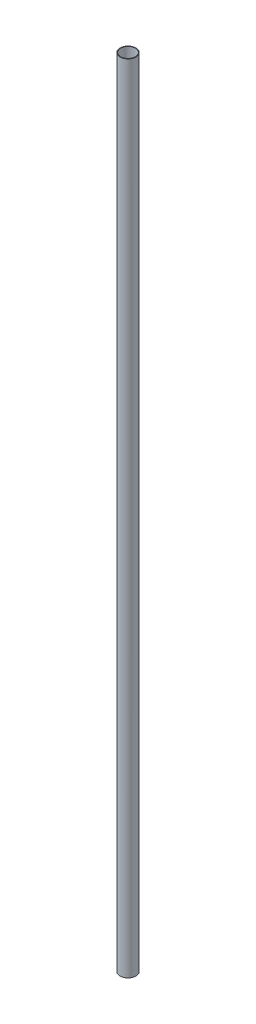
ISO-10303-21;
HEADER;
FILE_DESCRIPTION(('STEP AP214'),'2;1');
FILE_NAME('part.step','',(''),(''),'','','');
FILE_SCHEMA(('AUTOMOTIVE_DESIGN { 1 0 10303 214 1 1 1 1 }'));
ENDSEC;
DATA;
#1=APPLICATION_CONTEXT('core data for automotive mechanical design processes');
#2=APPLICATION_PROTOCOL_DEFINITION('international standard','automotive_design',2000,#1);
#3=PRODUCT_CONTEXT('',#1,'mechanical');
#4=PRODUCT('Part','Part','',(#3));
#5=PRODUCT_RELATED_PRODUCT_CATEGORY('part','',(#4));
#6=PRODUCT_DEFINITION_FORMATION('','',#4);
#7=PRODUCT_DEFINITION_CONTEXT('part definition',#1,'design');
#8=PRODUCT_DEFINITION('design','',#6,#7);
#9=PRODUCT_DEFINITION_SHAPE('','',#8);
#10=(LENGTH_UNIT() NAMED_UNIT(*) SI_UNIT(.MILLI.,.METRE.));
#11=(NAMED_UNIT(*) PLANE_ANGLE_UNIT() SI_UNIT($,.RADIAN.));
#12=(NAMED_UNIT(*) SI_UNIT($,.STERADIAN.) SOLID_ANGLE_UNIT());
#13=UNCERTAINTY_MEASURE_WITH_UNIT(LENGTH_MEASURE(1.E-05),#10,'distance_accuracy_value','');
#14=(GEOMETRIC_REPRESENTATION_CONTEXT(3) GLOBAL_UNCERTAINTY_ASSIGNED_CONTEXT((#13)) GLOBAL_UNIT_ASSIGNED_CONTEXT((#10,
#11,#12)) REPRESENTATION_CONTEXT('',''));
#15=CARTESIAN_POINT('',(0.,0.,0.));
#16=DIRECTION('',(0.,0.,1.));
#17=DIRECTION('',(1.,0.,0.));
#18=AXIS2_PLACEMENT_3D('',#15,#16,#17);
#19=CARTESIAN_POINT('',(0.,3000.,0.));
#20=DIRECTION('',(0.,1.,0.));
#21=DIRECTION('',(0.,0.,1.));
#22=AXIS2_PLACEMENT_3D('',#19,#20,#21);
#23=PLANE('',#22);
#24=CARTESIAN_POINT('',(0.,3000.,0.));
#25=DIRECTION('',(0.,1.,0.));
#26=DIRECTION('',(0.,0.,1.));
#27=AXIS2_PLACEMENT_3D('',#24,#25,#26);
#28=CIRCLE('',#27,30.);
#29=CARTESIAN_POINT('',(0.,3000.,30.));
#30=VERTEX_POINT('',#29);
#31=EDGE_CURVE('E143',#30,#30,#28,.T.);
#32=ORIENTED_EDGE('',*,*,#31,.T.);
#33=EDGE_LOOP('',(#32));
#34=FACE_BOUND('',#33,.T.);
#35=CARTESIAN_POINT('',(0.,3000.,0.));
#36=DIRECTION('',(0.,1.,0.));
#37=DIRECTION('',(0.,0.,1.));
#38=AXIS2_PLACEMENT_3D('',#35,#36,#37);
#39=CIRCLE('',#38,28.);
#40=CARTESIAN_POINT('',(0.,3000.,28.));
#41=VERTEX_POINT('',#40);
#42=EDGE_CURVE('E146',#41,#41,#39,.T.);
#43=ORIENTED_EDGE('',*,*,#42,.F.);
#44=EDGE_LOOP('',(#43));
#45=FACE_BOUND('',#44,.T.);
#46=ADVANCED_FACE('F33',(#34,#45),#23,.T.);
#47=CARTESIAN_POINT('',(0.,3000.,0.));
#48=DIRECTION('',(0.,-1.,0.));
#49=DIRECTION('',(0.,0.,-1.));
#50=AXIS2_PLACEMENT_3D('',#47,#48,#49);
#51=CYLINDRICAL_SURFACE('',#50,30.);
#52=CARTESIAN_POINT('',(-30.,102.5,0.));
#53=CARTESIAN_POINT('',(-30.0000009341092,102.499997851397,-0.139438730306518));
#54=CARTESIAN_POINT('',(-29.9990260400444,102.505834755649,-0.27884837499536));
#55=CARTESIAN_POINT('',(-29.9951557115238,102.529134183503,-0.556708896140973));
#56=CARTESIAN_POINT('',(-29.9922598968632,102.546599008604,-0.695159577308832));
#57=CARTESIAN_POINT('',(-29.9846251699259,102.593038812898,-0.970150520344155));
#58=CARTESIAN_POINT('',(-29.979885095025,102.622021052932,-1.10668952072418));
#59=CARTESIAN_POINT('',(-29.9686930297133,102.691286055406,-1.37685247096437));
#60=CARTESIAN_POINT('',(-29.9622404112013,102.731572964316,-1.51047533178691));
#61=CARTESIAN_POINT('',(-29.9478128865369,102.823085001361,-1.77365528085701));
#62=CARTESIAN_POINT('',(-29.9398398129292,102.874296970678,-1.90321704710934));
#63=CARTESIAN_POINT('',(-29.9225843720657,102.987331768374,-2.15759207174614));
#64=CARTESIAN_POINT('',(-29.9133015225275,103.049158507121,-2.28240355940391));
#65=CARTESIAN_POINT('',(-29.8936901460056,103.182931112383,-2.5263122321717));
#66=CARTESIAN_POINT('',(-29.8833621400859,103.254871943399,-2.64541222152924));
#67=CARTESIAN_POINT('',(-29.8619368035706,103.408417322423,-2.87720075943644));
#68=CARTESIAN_POINT('',(-29.8508391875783,103.490025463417,-2.98988690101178));
#69=CARTESIAN_POINT('',(-29.8280901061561,103.66302595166,-3.20893550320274));
#70=CARTESIAN_POINT('',(-29.8164348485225,103.754492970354,-3.3152386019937));
#71=CARTESIAN_POINT('',(-29.792977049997,103.946055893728,-3.51981905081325));
#72=CARTESIAN_POINT('',(-29.7811744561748,104.04615498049,-3.6180934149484));
#73=CARTESIAN_POINT('',(-29.757760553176,104.254234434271,-3.80586900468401));
#74=CARTESIAN_POINT('',(-29.7461491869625,104.362212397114,-3.89537288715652));
#75=CARTESIAN_POINT('',(-29.7234367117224,104.58537924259,-4.06505128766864));
#76=CARTESIAN_POINT('',(-29.7123357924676,104.700570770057,-4.14522235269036));
#77=CARTESIAN_POINT('',(-29.6909016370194,104.938028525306,-4.29606801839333));
#78=CARTESIAN_POINT('',(-29.6805732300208,105.060331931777,-4.36668480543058));
#79=CARTESIAN_POINT('',(-29.6610510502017,105.310589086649,-4.49737903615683));
#80=CARTESIAN_POINT('',(-29.6518577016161,105.438544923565,-4.55745254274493));
#81=CARTESIAN_POINT('',(-29.6348831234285,105.699119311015,-4.66655756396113));
#82=CARTESIAN_POINT('',(-29.6271012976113,105.831735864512,-4.7155937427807));
#83=CARTESIAN_POINT('',(-29.6131700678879,106.100732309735,-4.80229722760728));
#84=CARTESIAN_POINT('',(-29.6070212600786,106.237113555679,-4.83996038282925));
#85=CARTESIAN_POINT('',(-29.5914227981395,106.647801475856,-4.93477467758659));
#86=CARTESIAN_POINT('',(-29.5846386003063,106.92636886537,-4.97488357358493));
#87=CARTESIAN_POINT('',(-29.5790755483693,107.486203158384,-5.00784793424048));
#88=CARTESIAN_POINT('',(-29.5802961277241,107.767469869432,-5.00070674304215));
#89=CARTESIAN_POINT('',(-29.590529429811,108.321844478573,-4.93978637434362));
#90=CARTESIAN_POINT('',(-29.5994616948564,108.59500659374,-4.88648873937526));
#91=CARTESIAN_POINT('',(-29.6239896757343,109.128445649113,-4.73550730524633));
#92=CARTESIAN_POINT('',(-29.6395856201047,109.388722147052,-4.63782198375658));
#93=CARTESIAN_POINT('',(-29.6757696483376,109.890456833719,-4.40035421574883));
#94=CARTESIAN_POINT('',(-29.6963813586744,110.131818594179,-4.2603717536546));
#95=CARTESIAN_POINT('',(-29.7402583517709,110.587809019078,-3.94242410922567));
#96=CARTESIAN_POINT('',(-29.7635238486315,110.802435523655,-3.76445586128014));
#97=CARTESIAN_POINT('',(-29.8104405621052,111.201652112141,-3.37296440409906));
#98=CARTESIAN_POINT('',(-29.8340929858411,111.38583702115,-3.15902792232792));
#99=CARTESIAN_POINT('',(-29.8788520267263,111.715755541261,-2.70307050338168));
#100=CARTESIAN_POINT('',(-29.8999586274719,111.861488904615,-2.46104938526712));
#101=CARTESIAN_POINT('',(-29.9372778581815,112.11040445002,-1.95541183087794));
#102=CARTESIAN_POINT('',(-29.9534863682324,112.213550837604,-1.69177745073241));
#103=CARTESIAN_POINT('',(-29.9791500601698,112.37398843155,-1.15059669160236));
#104=CARTESIAN_POINT('',(-29.988605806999,112.431283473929,-0.873051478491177));
#105=CARTESIAN_POINT('',(-29.999622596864,112.497842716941,-0.315419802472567));
#106=CARTESIAN_POINT('',(-30.0012750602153,112.507663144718,-0.0354014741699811));
#107=CARTESIAN_POINT('',(-29.9967494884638,112.480477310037,0.522279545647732));
#108=CARTESIAN_POINT('',(-29.9905717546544,112.443472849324,0.799942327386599));
#109=CARTESIAN_POINT('',(-29.971136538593,112.324150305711,1.3433123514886));
#110=CARTESIAN_POINT('',(-29.9579220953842,112.242107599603,1.60908173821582));
#111=CARTESIAN_POINT('',(-29.9258892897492,112.035330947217,2.12309376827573));
#112=CARTESIAN_POINT('',(-29.9070706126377,111.910594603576,2.37133542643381));
#113=CARTESIAN_POINT('',(-29.8656903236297,111.620697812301,2.84566138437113));
#114=CARTESIAN_POINT('',(-29.8430971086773,111.455189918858,3.07153052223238));
#115=CARTESIAN_POINT('',(-29.7967693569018,111.088925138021,3.49248715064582));
#116=CARTESIAN_POINT('',(-29.7730347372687,110.88816569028,3.68757240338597));
#117=CARTESIAN_POINT('',(-29.7268034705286,110.454605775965,4.04348563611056));
#118=CARTESIAN_POINT('',(-29.7043221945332,110.221494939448,4.20393781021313));
#119=CARTESIAN_POINT('',(-29.6634307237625,109.73129079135,4.48340433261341));
#120=CARTESIAN_POINT('',(-29.6450203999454,109.474198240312,4.60241999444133));
#121=CARTESIAN_POINT('',(-29.6144685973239,108.944432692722,4.79507773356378));
#122=CARTESIAN_POINT('',(-29.602301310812,108.671829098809,4.86890685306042));
#123=CARTESIAN_POINT('',(-29.5855561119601,108.117714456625,4.96966691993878));
#124=CARTESIAN_POINT('',(-29.580977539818,107.836204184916,4.99660194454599));
#125=CARTESIAN_POINT('',(-29.5801885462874,107.415590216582,5.0012321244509));
#126=CARTESIAN_POINT('',(-29.5809172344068,107.276463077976,4.99693975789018));
#127=CARTESIAN_POINT('',(-29.5843160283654,106.999087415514,4.97678436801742));
#128=CARTESIAN_POINT('',(-29.5869854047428,106.860838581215,4.96092569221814));
#129=CARTESIAN_POINT('',(-29.5941926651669,106.586152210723,4.91774640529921));
#130=CARTESIAN_POINT('',(-29.5987312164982,106.449715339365,4.89042170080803));
#131=CARTESIAN_POINT('',(-29.6095423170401,106.179703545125,4.82453301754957));
#132=CARTESIAN_POINT('',(-29.615814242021,106.046127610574,4.7859730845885));
#133=CARTESIAN_POINT('',(-29.6299071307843,105.782831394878,4.6979342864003));
#134=CARTESIAN_POINT('',(-29.6377268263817,105.653108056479,4.6484643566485));
#135=CARTESIAN_POINT('',(-29.6546930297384,105.398341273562,4.53896986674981));
#136=CARTESIAN_POINT('',(-29.6638390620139,105.273296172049,4.47894908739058));
#137=CARTESIAN_POINT('',(-29.6832065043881,105.0286385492,4.34874498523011));
#138=CARTESIAN_POINT('',(-29.6934283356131,104.909028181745,4.27855767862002));
#139=CARTESIAN_POINT('',(-29.7146554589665,104.676138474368,4.12855715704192));
#140=CARTESIAN_POINT('',(-29.7256604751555,104.562856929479,4.04874732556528));
#141=CARTESIAN_POINT('',(-29.7482907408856,104.341991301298,3.87899685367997));
#142=CARTESIAN_POINT('',(-29.7599219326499,104.234493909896,3.78894418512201));
#143=CARTESIAN_POINT('',(-29.783347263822,104.027486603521,3.60017574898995));
#144=CARTESIAN_POINT('',(-29.7951413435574,103.927973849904,3.50146308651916));
#145=CARTESIAN_POINT('',(-29.8185735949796,103.737518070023,3.29596225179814));
#146=CARTESIAN_POINT('',(-29.8302116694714,103.646580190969,3.18916929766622));
#147=CARTESIAN_POINT('',(-29.8529952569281,103.474004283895,2.96833108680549));
#148=CARTESIAN_POINT('',(-29.8641409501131,103.392362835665,2.8542885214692));
#149=CARTESIAN_POINT('',(-29.8857116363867,103.238354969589,2.6188382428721));
#150=CARTESIAN_POINT('',(-29.896130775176,103.166060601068,2.49738284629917));
#151=CARTESIAN_POINT('',(-29.9158586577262,103.032003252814,2.24876507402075));
#152=CARTESIAN_POINT('',(-29.925167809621,102.970236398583,2.1216048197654));
#153=CARTESIAN_POINT('',(-29.9424090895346,102.857699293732,1.86251821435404));
#154=CARTESIAN_POINT('',(-29.950342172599,102.806921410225,1.73059524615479));
#155=CARTESIAN_POINT('',(-29.9646113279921,102.716705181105,1.46288984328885));
#156=CARTESIAN_POINT('',(-29.9709477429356,102.677264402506,1.32710824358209));
#157=CARTESIAN_POINT('',(-29.9841083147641,102.59602169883,0.995492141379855));
#158=CARTESIAN_POINT('',(-29.9900398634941,102.560056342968,0.798161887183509));
#159=CARTESIAN_POINT('',(-29.9979850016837,102.512047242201,0.400534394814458));
#160=CARTESIAN_POINT('',(-29.9999986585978,102.500003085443,0.20023720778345));
#161=CARTESIAN_POINT('',(-30.,102.5,0.));
#162=B_SPLINE_CURVE_WITH_KNOTS('',3,(#52,#53,#54,#55,#56,#57,#58,#59,#60,#61,#62,#63,#64,#65,
#66,#67,#68,#69,#70,#71,#72,#73,#74,#75,#76,#77,#78,#79,#80,#81,#82,#83,#84,#85,#86,#87,#88,#89,
#90,#91,#92,#93,#94,#95,#96,#97,#98,#99,#100,#101,#102,#103,#104,#105,#106,#107,#108,#109,#110,
#111,#112,#113,#114,#115,#116,#117,#118,#119,#120,#121,#122,#123,#124,#125,#126,#127,#128,#129,
#130,#131,#132,#133,#134,#135,#136,#137,#138,#139,#140,#141,#142,#143,#144,#145,#146,#147,#148,
#149,#150,#151,#152,#153,#154,#155,#156,#157,#158,#159,#160,#161),.UNSPECIFIED.,.T.,.F.,(4,2,2,
2,2,2,2,2,2,2,2,2,2,2,2,2,2,2,2,2,2,2,2,2,2,2,2,2,2,2,2,2,2,2,2,2,2,2,2,2,2,2,2,2,2,2,2,2,2,2,2,
2,2,2,4),(0.,0.418140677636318,0.83636414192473,1.25485168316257,1.67349292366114,
2.09163274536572,2.50992693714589,2.92801360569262,3.3462561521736,3.767924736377,
4.18974943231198,4.61144594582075,5.03329798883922,5.45759827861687,5.88205667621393,
6.30633536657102,6.73076871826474,7.57090272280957,8.41097726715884,9.24239161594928,
10.0738344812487,10.9092723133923,11.7447775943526,12.5906365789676,13.4365010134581,
14.2830749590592,15.1295780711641,15.9661388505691,16.8026674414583,17.6341373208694,
18.4656538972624,19.3045176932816,20.1434424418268,20.9910576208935,21.83864592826,
22.6827016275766,23.5266839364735,23.9438629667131,24.3608852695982,24.77805657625,
25.1950778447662,25.611758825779,26.0282907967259,26.4449864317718,26.8615359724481,
27.2831832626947,27.7046799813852,28.1264281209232,28.5480205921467,28.9726903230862,
29.3972034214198,29.8214207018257,30.2455468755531,30.8460167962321,31.4464763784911),.UNSPECIFIED.);
#163=CARTESIAN_POINT('',(-30.,102.5,0.));
#164=VERTEX_POINT('',#163);
#165=EDGE_CURVE('E161',#164,#164,#162,.T.);
#166=ORIENTED_EDGE('',*,*,#165,.T.);
#167=EDGE_LOOP('',(#166));
#168=FACE_BOUND('',#167,.T.);
#169=CARTESIAN_POINT('',(-30.,42.5,0.));
#170=CARTESIAN_POINT('',(-30.0000009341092,42.499997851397,-0.139438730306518));
#171=CARTESIAN_POINT('',(-29.9990260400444,42.5058347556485,-0.278848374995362));
#172=CARTESIAN_POINT('',(-29.9951557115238,42.5291341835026,-0.556708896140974));
#173=CARTESIAN_POINT('',(-29.9922598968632,42.5465990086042,-0.695159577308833));
#174=CARTESIAN_POINT('',(-29.9846251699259,42.5930388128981,-0.970150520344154));
#175=CARTESIAN_POINT('',(-29.979885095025,42.6220210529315,-1.10668952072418));
#176=CARTESIAN_POINT('',(-29.9686930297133,42.6912860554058,-1.37685247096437));
#177=CARTESIAN_POINT('',(-29.9622404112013,42.7315729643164,-1.51047533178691));
#178=CARTESIAN_POINT('',(-29.9478128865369,42.8230850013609,-1.77365528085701));
#179=CARTESIAN_POINT('',(-29.9398398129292,42.8742969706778,-1.90321704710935));
#180=CARTESIAN_POINT('',(-29.9225843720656,42.987331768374,-2.15759207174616));
#181=CARTESIAN_POINT('',(-29.9133015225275,43.0491585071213,-2.28240355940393));
#182=CARTESIAN_POINT('',(-29.8936901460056,43.1829311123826,-2.52631223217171));
#183=CARTESIAN_POINT('',(-29.8833621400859,43.2548719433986,-2.64541222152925));
#184=CARTESIAN_POINT('',(-29.8619368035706,43.4084173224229,-2.87720075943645));
#185=CARTESIAN_POINT('',(-29.8508391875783,43.4900254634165,-2.98988690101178));
#186=CARTESIAN_POINT('',(-29.8280901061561,43.6630259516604,-3.20893550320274));
#187=CARTESIAN_POINT('',(-29.8164348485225,43.7544929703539,-3.3152386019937));
#188=CARTESIAN_POINT('',(-29.792977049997,43.9460558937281,-3.51981905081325));
#189=CARTESIAN_POINT('',(-29.7811744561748,44.0461549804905,-3.6180934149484));
#190=CARTESIAN_POINT('',(-29.757760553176,44.2542344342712,-3.80586900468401));
#191=CARTESIAN_POINT('',(-29.7461491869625,44.362212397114,-3.89537288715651));
#192=CARTESIAN_POINT('',(-29.7234367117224,44.5853792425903,-4.06505128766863));
#193=CARTESIAN_POINT('',(-29.7123357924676,44.7005707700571,-4.14522235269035));
#194=CARTESIAN_POINT('',(-29.6909016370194,44.9380285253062,-4.29606801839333));
#195=CARTESIAN_POINT('',(-29.6805732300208,45.0603319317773,-4.36668480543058));
#196=CARTESIAN_POINT('',(-29.6610510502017,45.3105890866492,-4.49737903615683));
#197=CARTESIAN_POINT('',(-29.6518577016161,45.4385449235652,-4.55745254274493));
#198=CARTESIAN_POINT('',(-29.6348831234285,45.699119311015,-4.66655756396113));
#199=CARTESIAN_POINT('',(-29.6271012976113,45.8317358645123,-4.7155937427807));
#200=CARTESIAN_POINT('',(-29.6131700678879,46.100732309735,-4.80229722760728));
#201=CARTESIAN_POINT('',(-29.6070212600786,46.2371135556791,-4.83996038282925));
#202=CARTESIAN_POINT('',(-29.5914227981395,46.6478014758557,-4.93477467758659));
#203=CARTESIAN_POINT('',(-29.5846386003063,46.9263688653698,-4.97488357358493));
#204=CARTESIAN_POINT('',(-29.5790755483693,47.4862031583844,-5.00784793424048));
#205=CARTESIAN_POINT('',(-29.5802961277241,47.7674698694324,-5.00070674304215));
#206=CARTESIAN_POINT('',(-29.590529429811,48.3218444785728,-4.93978637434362));
#207=CARTESIAN_POINT('',(-29.5994616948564,48.5950065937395,-4.88648873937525));
#208=CARTESIAN_POINT('',(-29.6239896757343,49.1284456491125,-4.73550730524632));
#209=CARTESIAN_POINT('',(-29.6395856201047,49.3887221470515,-4.63782198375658));
#210=CARTESIAN_POINT('',(-29.6757696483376,49.8904568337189,-4.40035421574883));
#211=CARTESIAN_POINT('',(-29.6963813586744,50.1318185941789,-4.26037175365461));
#212=CARTESIAN_POINT('',(-29.7402583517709,50.5878090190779,-3.94242410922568));
#213=CARTESIAN_POINT('',(-29.7635238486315,50.8024355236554,-3.76445586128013));
#214=CARTESIAN_POINT('',(-29.8104405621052,51.2016521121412,-3.37296440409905));
#215=CARTESIAN_POINT('',(-29.8340929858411,51.3858370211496,-3.15902792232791));
#216=CARTESIAN_POINT('',(-29.8788520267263,51.7157555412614,-2.70307050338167));
#217=CARTESIAN_POINT('',(-29.8999586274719,51.861488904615,-2.46104938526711));
#218=CARTESIAN_POINT('',(-29.9372778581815,52.1104044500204,-1.95541183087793));
#219=CARTESIAN_POINT('',(-29.9534863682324,52.2135508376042,-1.6917774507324));
#220=CARTESIAN_POINT('',(-29.9791500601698,52.3739884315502,-1.15059669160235));
#221=CARTESIAN_POINT('',(-29.988605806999,52.4312834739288,-0.873051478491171));
#222=CARTESIAN_POINT('',(-29.999622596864,52.4978427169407,-0.315419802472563));
#223=CARTESIAN_POINT('',(-30.0012750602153,52.5076631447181,-0.0354014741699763));
#224=CARTESIAN_POINT('',(-29.9967494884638,52.4804773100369,0.522279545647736));
#225=CARTESIAN_POINT('',(-29.9905717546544,52.4434728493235,0.799942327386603));
#226=CARTESIAN_POINT('',(-29.971136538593,52.3241503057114,1.3433123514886));
#227=CARTESIAN_POINT('',(-29.9579220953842,52.2421075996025,1.60908173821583));
#228=CARTESIAN_POINT('',(-29.9258892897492,52.0353309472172,2.12309376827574));
#229=CARTESIAN_POINT('',(-29.9070706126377,51.9105946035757,2.37133542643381));
#230=CARTESIAN_POINT('',(-29.8656903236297,51.6206978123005,2.84566138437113));
#231=CARTESIAN_POINT('',(-29.8430971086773,51.4551899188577,3.07153052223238));
#232=CARTESIAN_POINT('',(-29.7967693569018,51.0889251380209,3.49248715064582));
#233=CARTESIAN_POINT('',(-29.7730347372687,50.8881656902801,3.68757240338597));
#234=CARTESIAN_POINT('',(-29.7268034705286,50.4546057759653,4.04348563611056));
#235=CARTESIAN_POINT('',(-29.7043221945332,50.2214949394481,4.20393781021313));
#236=CARTESIAN_POINT('',(-29.6634307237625,49.7312907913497,4.48340433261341));
#237=CARTESIAN_POINT('',(-29.6450203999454,49.4741982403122,4.60241999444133));
#238=CARTESIAN_POINT('',(-29.6144685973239,48.9444326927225,4.79507773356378));
#239=CARTESIAN_POINT('',(-29.602301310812,48.6718290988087,4.86890685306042));
#240=CARTESIAN_POINT('',(-29.5855561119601,48.1177144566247,4.96966691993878));
#241=CARTESIAN_POINT('',(-29.580977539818,47.8362041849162,4.99660194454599));
#242=CARTESIAN_POINT('',(-29.5801885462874,47.4155902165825,5.0012321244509));
#243=CARTESIAN_POINT('',(-29.5809172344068,47.2764630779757,4.99693975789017));
#244=CARTESIAN_POINT('',(-29.5843160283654,46.9990874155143,4.97678436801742));
#245=CARTESIAN_POINT('',(-29.5869854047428,46.8608385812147,4.96092569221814));
#246=CARTESIAN_POINT('',(-29.5941926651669,46.5861522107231,4.91774640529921));
#247=CARTESIAN_POINT('',(-29.5987312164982,46.4497153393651,4.89042170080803));
#248=CARTESIAN_POINT('',(-29.6095423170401,46.1797035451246,4.82453301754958));
#249=CARTESIAN_POINT('',(-29.615814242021,46.0461276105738,4.7859730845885));
#250=CARTESIAN_POINT('',(-29.6299071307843,45.7828313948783,4.6979342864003));
#251=CARTESIAN_POINT('',(-29.6377268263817,45.653108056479,4.6484643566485));
#252=CARTESIAN_POINT('',(-29.6546930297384,45.3983412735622,4.53896986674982));
#253=CARTESIAN_POINT('',(-29.6638390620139,45.273296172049,4.47894908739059));
#254=CARTESIAN_POINT('',(-29.6832065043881,45.0286385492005,4.34874498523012));
#255=CARTESIAN_POINT('',(-29.6934283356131,44.9090281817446,4.27855767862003));
#256=CARTESIAN_POINT('',(-29.7146554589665,44.6761384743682,4.12855715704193));
#257=CARTESIAN_POINT('',(-29.7256604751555,44.5628569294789,4.04874732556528));
#258=CARTESIAN_POINT('',(-29.7482907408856,44.3419913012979,3.87899685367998));
#259=CARTESIAN_POINT('',(-29.7599219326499,44.2344939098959,3.78894418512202));
#260=CARTESIAN_POINT('',(-29.783347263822,44.027486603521,3.60017574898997));
#261=CARTESIAN_POINT('',(-29.7951413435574,43.9279738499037,3.50146308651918));
#262=CARTESIAN_POINT('',(-29.8185735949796,43.7375180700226,3.29596225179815));
#263=CARTESIAN_POINT('',(-29.8302116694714,43.6465801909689,3.18916929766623));
#264=CARTESIAN_POINT('',(-29.8529952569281,43.4740042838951,2.9683310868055));
#265=CARTESIAN_POINT('',(-29.8641409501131,43.3923628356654,2.8542885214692));
#266=CARTESIAN_POINT('',(-29.8857116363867,43.2383549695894,2.61883824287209));
#267=CARTESIAN_POINT('',(-29.896130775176,43.1660606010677,2.49738284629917));
#268=CARTESIAN_POINT('',(-29.9158586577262,43.0320032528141,2.24876507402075));
#269=CARTESIAN_POINT('',(-29.925167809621,42.9702363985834,2.1216048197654));
#270=CARTESIAN_POINT('',(-29.9424090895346,42.8576992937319,1.86251821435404));
#271=CARTESIAN_POINT('',(-29.950342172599,42.8069214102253,1.73059524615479));
#272=CARTESIAN_POINT('',(-29.9646113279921,42.7167051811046,1.46288984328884));
#273=CARTESIAN_POINT('',(-29.9709477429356,42.6772644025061,1.32710824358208));
#274=CARTESIAN_POINT('',(-29.9841083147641,42.5960216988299,0.995492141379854));
#275=CARTESIAN_POINT('',(-29.9900398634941,42.5600563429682,0.798161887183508));
#276=CARTESIAN_POINT('',(-29.9979850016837,42.5120472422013,0.400534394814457));
#277=CARTESIAN_POINT('',(-29.9999986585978,42.5000030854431,0.200237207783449));
#278=CARTESIAN_POINT('',(-30.,42.5,0.));
#279=B_SPLINE_CURVE_WITH_KNOTS('',3,(#169,#170,#171,#172,#173,#174,#175,#176,#177,#178,#179,
#180,#181,#182,#183,#184,#185,#186,#187,#188,#189,#190,#191,#192,#193,#194,#195,#196,#197,#198,
#199,#200,#201,#202,#203,#204,#205,#206,#207,#208,#209,#210,#211,#212,#213,#214,#215,#216,#217,
#218,#219,#220,#221,#222,#223,#224,#225,#226,#227,#228,#229,#230,#231,#232,#233,#234,#235,#236,
#237,#238,#239,#240,#241,#242,#243,#244,#245,#246,#247,#248,#249,#250,#251,#252,#253,#254,#255,
#256,#257,#258,#259,#260,#261,#262,#263,#264,#265,#266,#267,#268,#269,#270,#271,#272,#273,#274,
#275,#276,#277,#278),.UNSPECIFIED.,.T.,.F.,(4,2,2,2,2,2,2,2,2,2,2,2,2,2,2,2,2,2,2,2,2,2,2,2,2,2,
2,2,2,2,2,2,2,2,2,2,2,2,2,2,2,2,2,2,2,2,2,2,2,2,2,2,2,2,4),(0.,0.418140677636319,
0.836364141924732,1.25485168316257,1.67349292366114,2.09163274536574,2.50992693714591,
2.92801360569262,3.3462561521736,3.767924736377,4.18974943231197,4.61144594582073,
5.03329798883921,5.45759827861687,5.88205667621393,6.30633536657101,6.73076871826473,
7.57090272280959,8.41097726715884,9.24239161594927,10.0738344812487,10.9092723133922,
11.7447775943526,12.5906365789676,13.4365010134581,14.2830749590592,15.1295780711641,
15.966138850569,16.8026674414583,17.6341373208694,18.4656538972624,19.3045176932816,
20.1434424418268,20.9910576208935,21.83864592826,22.6827016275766,23.5266839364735,
23.943862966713,24.3608852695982,24.7780565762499,25.1950778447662,25.6117588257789,
26.0282907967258,26.4449864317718,26.861535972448,27.2831832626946,27.7046799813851,
28.1264281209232,28.5480205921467,28.9726903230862,29.3972034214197,29.8214207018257,
30.2455468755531,30.8460167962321,31.446476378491),.UNSPECIFIED.);
#280=CARTESIAN_POINT('',(-30.,42.5,0.));
#281=VERTEX_POINT('',#280);
#282=EDGE_CURVE('E96',#281,#281,#279,.T.);
#283=ORIENTED_EDGE('',*,*,#282,.T.);
#284=EDGE_LOOP('',(#283));
#285=FACE_BOUND('',#284,.T.);
#286=ORIENTED_EDGE('',*,*,#31,.F.);
#287=EDGE_LOOP('',(#286));
#288=FACE_BOUND('',#287,.T.);
#289=DIRECTION('',(0.,-1.,0.));
#290=VECTOR('',#289,1.);
#291=CARTESIAN_POINT('',(-19.2613602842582,3000.,-23.));
#292=LINE('',#291,#290);
#293=CARTESIAN_POINT('',(-19.2613602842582,-23.,-23.));
#294=VERTEX_POINT('',#293);
#295=CARTESIAN_POINT('',(-19.2613602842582,4.99999999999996,-23.));
#296=VERTEX_POINT('',#295);
#297=EDGE_CURVE('E55',#294,#296,#292,.F.);
#298=ORIENTED_EDGE('',*,*,#297,.T.);
#299=CARTESIAN_POINT('',(-19.2613602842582,4.99999999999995,-23.));
#300=CARTESIAN_POINT('',(-19.2613276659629,5.26859181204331,-23.0000128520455));
#301=CARTESIAN_POINT('',(-19.2669775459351,5.53717033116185,-22.995295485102));
#302=CARTESIAN_POINT('',(-19.2893994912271,6.07348487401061,-22.9764979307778));
#303=CARTESIAN_POINT('',(-19.3061694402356,6.34122104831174,-22.9624195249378));
#304=CARTESIAN_POINT('',(-19.3505360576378,6.87450281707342,-22.9250419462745));
#305=CARTESIAN_POINT('',(-19.3781068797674,7.14005210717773,-22.9017647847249));
#306=CARTESIAN_POINT('',(-19.4436139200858,7.66889848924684,-22.8461749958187));
#307=CARTESIAN_POINT('',(-19.4815505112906,7.9321954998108,-22.813862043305));
#308=CARTESIAN_POINT('',(-19.6088470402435,8.71021997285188,-22.7047491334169));
#309=CARTESIAN_POINT('',(-19.7123800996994,9.22094698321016,-22.615210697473));
#310=CARTESIAN_POINT('',(-19.9522250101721,10.2279100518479,-22.4038863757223));
#311=CARTESIAN_POINT('',(-20.0885583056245,10.7241363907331,-22.2820793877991));
#312=CARTESIAN_POINT('',(-20.4209512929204,11.8070561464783,-21.9783044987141));
#313=CARTESIAN_POINT('',(-20.6235523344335,12.3896793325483,-21.7889989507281));
#314=CARTESIAN_POINT('',(-21.0583395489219,13.5282385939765,-21.3690812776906));
#315=CARTESIAN_POINT('',(-21.2905317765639,14.0841691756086,-21.1384606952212));
#316=CARTESIAN_POINT('',(-21.7768665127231,15.1720195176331,-20.6371207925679));
#317=CARTESIAN_POINT('',(-22.031127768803,15.703782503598,-20.3661781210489));
#318=CARTESIAN_POINT('',(-22.5526636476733,16.7398013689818,-19.7870974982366));
#319=CARTESIAN_POINT('',(-22.8199373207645,17.2440592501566,-19.4789622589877));
#320=CARTESIAN_POINT('',(-23.3672094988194,18.2363767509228,-18.8191782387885));
#321=CARTESIAN_POINT('',(-23.647359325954,18.7237932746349,-18.4666888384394));
#322=CARTESIAN_POINT('',(-24.2083611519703,19.669339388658,-17.7248850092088));
#323=CARTESIAN_POINT('',(-24.489213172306,20.1274680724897,-17.3355694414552));
#324=CARTESIAN_POINT('',(-25.0456726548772,21.012617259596,-16.5214104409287));
#325=CARTESIAN_POINT('',(-25.3212885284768,21.4396914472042,-16.0966311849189));
#326=CARTESIAN_POINT('',(-25.862723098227,22.2619857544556,-15.2114660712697));
#327=CARTESIAN_POINT('',(-26.1285423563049,22.6572077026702,-14.7510822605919));
#328=CARTESIAN_POINT('',(-26.6345719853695,23.3975614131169,-13.8155817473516));
#329=CARTESIAN_POINT('',(-26.8753900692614,23.7441052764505,-13.341913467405));
#330=CARTESIAN_POINT('',(-27.3393533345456,24.4034818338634,-12.3633699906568));
#331=CARTESIAN_POINT('',(-27.5624982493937,24.7163140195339,-11.8584943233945));
#332=CARTESIAN_POINT('',(-27.9867799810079,25.3052090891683,-10.8191970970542));
#333=CARTESIAN_POINT('',(-28.187926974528,25.5812889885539,-10.2847893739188));
#334=CARTESIAN_POINT('',(-28.5641282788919,26.0935928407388,-9.18837740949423));
#335=CARTESIAN_POINT('',(-28.7391869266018,26.3298234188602,-8.62637777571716));
#336=CARTESIAN_POINT('',(-29.0351990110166,26.7268850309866,-7.56399870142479));
#337=CARTESIAN_POINT('',(-29.1603293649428,26.8937106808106,-7.06701821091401));
#338=CARTESIAN_POINT('',(-29.3865737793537,27.1941546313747,-6.0577725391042));
#339=CARTESIAN_POINT('',(-29.4876901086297,27.3277760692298,-5.54550880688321));
#340=CARTESIAN_POINT('',(-29.6638758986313,27.5599478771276,-4.50895483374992));
#341=CARTESIAN_POINT('',(-29.7389589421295,27.658516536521,-3.9846710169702));
#342=CARTESIAN_POINT('',(-29.8615796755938,27.8192165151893,-2.92733277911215));
#343=CARTESIAN_POINT('',(-29.9091170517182,27.8813474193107,-2.39427825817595));
#344=CARTESIAN_POINT('',(-29.9756950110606,27.9683059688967,-1.32180657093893));
#345=CARTESIAN_POINT('',(-29.9946535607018,27.9930262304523,-0.782375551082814));
#346=CARTESIAN_POINT('',(-30.0033841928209,28.0044142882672,0.297127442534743));
#347=CARTESIAN_POINT('',(-29.9931562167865,27.9910820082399,0.837199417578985));
#348=CARTESIAN_POINT('',(-29.9437439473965,27.9265834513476,1.91380017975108));
#349=CARTESIAN_POINT('',(-29.9045560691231,27.875412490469,2.45032851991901));
#350=CARTESIAN_POINT('',(-29.798093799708,27.7360597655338,3.51570857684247));
#351=CARTESIAN_POINT('',(-29.7308197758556,27.64787848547,4.04456039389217));
#352=CARTESIAN_POINT('',(-29.5730210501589,27.4403189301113,5.0688885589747));
#353=CARTESIAN_POINT('',(-29.4835922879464,27.3224074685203,5.56483349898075));
#354=CARTESIAN_POINT('',(-29.2819513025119,27.0553923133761,6.54346475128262));
#355=CARTESIAN_POINT('',(-29.169739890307,26.9062897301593,7.02615153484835));
#356=CARTESIAN_POINT('',(-28.9244565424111,26.5786002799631,7.97599300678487));
#357=CARTESIAN_POINT('',(-28.7913820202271,26.4000097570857,8.44314576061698));
#358=CARTESIAN_POINT('',(-28.5065049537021,26.0151744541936,9.36000419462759));
#359=CARTESIAN_POINT('',(-28.3547012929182,25.8089280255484,9.80970883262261));
#360=CARTESIAN_POINT('',(-28.0177155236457,25.3474764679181,10.7366547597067));
#361=CARTESIAN_POINT('',(-27.8307017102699,25.0894022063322,11.2118012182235));
#362=CARTESIAN_POINT('',(-27.4395943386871,24.5439880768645,12.1375965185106));
#363=CARTESIAN_POINT('',(-27.2354997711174,24.2566464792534,12.588243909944));
#364=CARTESIAN_POINT('',(-26.8132379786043,23.6546454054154,13.4642789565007));
#365=CARTESIAN_POINT('',(-26.5950643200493,23.3399734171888,13.8896548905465));
#366=CARTESIAN_POINT('',(-26.1478421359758,22.6852147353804,14.7142927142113));
#367=CARTESIAN_POINT('',(-25.9187930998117,22.345126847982,15.1135533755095));
#368=CARTESIAN_POINT('',(-25.406190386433,21.570308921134,15.9630330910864));
#369=CARTESIAN_POINT('',(-25.1209232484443,21.130282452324,16.4073987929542));
#370=CARTESIAN_POINT('',(-24.5448102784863,20.217525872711,17.2573440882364));
#371=CARTESIAN_POINT('',(-24.2539634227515,19.7447897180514,17.6629164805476));
#372=CARTESIAN_POINT('',(-23.6723293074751,18.7671294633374,18.435150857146));
#373=CARTESIAN_POINT('',(-23.381542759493,18.2621592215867,18.8017549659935));
#374=CARTESIAN_POINT('',(-22.8072570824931,17.2212712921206,19.4943906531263));
#375=CARTESIAN_POINT('',(-22.523756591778,16.6853594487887,19.820429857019));
#376=CARTESIAN_POINT('',(-22.0195782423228,15.6779035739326,20.3777831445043));
#377=CARTESIAN_POINT('',(-21.7965055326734,15.2112239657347,20.6157324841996));
#378=CARTESIAN_POINT('',(-21.365968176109,14.2566761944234,21.061609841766));
#379=CARTESIAN_POINT('',(-21.1585037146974,13.7688077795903,21.2695375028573));
#380=CARTESIAN_POINT('',(-20.7662777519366,12.7746896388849,21.6526327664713));
#381=CARTESIAN_POINT('',(-20.5814061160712,12.2685460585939,21.8279616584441));
#382=CARTESIAN_POINT('',(-20.2399824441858,11.2364813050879,22.1449190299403));
#383=CARTESIAN_POINT('',(-20.0834229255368,10.7105654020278,22.2865564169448));
#384=CARTESIAN_POINT('',(-19.8374160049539,9.76259781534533,22.5055007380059));
#385=CARTESIAN_POINT('',(-19.74080213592,9.34409011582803,22.5901122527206));
#386=CARTESIAN_POINT('',(-19.5720910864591,8.49833129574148,22.7364409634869));
#387=CARTESIAN_POINT('',(-19.4999843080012,8.07108366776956,22.7981671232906));
#388=CARTESIAN_POINT('',(-19.3824021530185,7.20527814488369,22.8982225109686));
#389=CARTESIAN_POINT('',(-19.3372274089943,6.7666476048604,22.9362878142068));
#390=CARTESIAN_POINT('',(-19.2918242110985,6.10588826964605,22.9744610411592));
#391=CARTESIAN_POINT('',(-19.280416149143,5.88499561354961,22.9840313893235));
#392=CARTESIAN_POINT('',(-19.2651788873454,5.44274558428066,22.9968026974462));
#393=CARTESIAN_POINT('',(-19.2613503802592,5.22138817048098,23.0000030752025));
#394=CARTESIAN_POINT('',(-19.2613602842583,4.99999999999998,23.));
#395=B_SPLINE_CURVE_WITH_KNOTS('',3,(#299,#300,#301,#302,#303,#304,#305,#306,#307,#308,#309,
#310,#311,#312,#313,#314,#315,#316,#317,#318,#319,#320,#321,#322,#323,#324,#325,#326,#327,#328,
#329,#330,#331,#332,#333,#334,#335,#336,#337,#338,#339,#340,#341,#342,#343,#344,#345,#346,#347,
#348,#349,#350,#351,#352,#353,#354,#355,#356,#357,#358,#359,#360,#361,#362,#363,#364,#365,#366,
#367,#368,#369,#370,#371,#372,#373,#374,#375,#376,#377,#378,#379,#380,#381,#382,#383,#384,#385,
#386,#387,#388,#389,#390,#391,#392,#393,#394),.UNSPECIFIED.,.F.,.F.,(4,2,2,2,2,2,2,2,2,2,2,2,2,
2,2,2,2,2,2,2,2,2,2,2,2,2,2,2,2,2,2,2,2,2,2,2,2,2,2,2,2,2,2,2,2,2,2,4),(0.,0.805652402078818,
1.61115152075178,2.4147347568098,3.21834691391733,4.80193302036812,6.38655728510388,
8.31924834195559,10.2523354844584,12.196558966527,14.1406407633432,16.1296229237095,
18.1186666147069,20.1041857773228,22.0895908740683,23.9909593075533,25.8923564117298,
27.7928701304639,29.6930675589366,31.3082888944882,32.9233575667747,34.5375823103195,
36.1518254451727,37.7706933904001,39.3895645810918,41.0086362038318,42.6276866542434,
44.178695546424,45.7296492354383,47.2807953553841,48.832033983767,50.5468043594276,
52.2616761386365,53.9773371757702,55.6930788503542,57.7531429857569,59.8135887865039,
61.8770532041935,63.9401291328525,65.6469628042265,67.3538167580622,69.0519868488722,
70.7497074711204,72.0617783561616,73.373334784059,74.6992700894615,75.3632577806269,
76.0273061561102),.UNSPECIFIED.);
#396=CARTESIAN_POINT('',(-19.2613602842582,5.,23.));
#397=VERTEX_POINT('',#396);
#398=EDGE_CURVE('E82',#296,#397,#395,.T.);
#399=ORIENTED_EDGE('',*,*,#398,.T.);
#400=DIRECTION('',(0.,-1.,0.));
#401=VECTOR('',#400,1.);
#402=CARTESIAN_POINT('',(-19.2613602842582,3000.,23.));
#403=LINE('',#402,#401);
#404=CARTESIAN_POINT('',(-19.2613602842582,-23.,23.));
#405=VERTEX_POINT('',#404);
#406=EDGE_CURVE('E91',#397,#405,#403,.T.);
#407=ORIENTED_EDGE('',*,*,#406,.T.);
#408=CARTESIAN_POINT('',(0.,-23.,0.));
#409=DIRECTION('',(0.,1.,0.));
#410=DIRECTION('',(0.,0.,1.));
#411=AXIS2_PLACEMENT_3D('',#408,#409,#410);
#412=CIRCLE('',#411,30.);
#413=EDGE_CURVE('E100',#405,#294,#412,.T.);
#414=ORIENTED_EDGE('',*,*,#413,.T.);
#415=EDGE_LOOP('',(#298,#399,#407,#414));
#416=FACE_BOUND('',#415,.T.);
#417=ADVANCED_FACE('F35',(#168,#285,#288,#416),#51,.T.);
#418=CARTESIAN_POINT('',(0.,3000.,0.));
#419=DIRECTION('',(0.,-1.,0.));
#420=DIRECTION('',(0.,0.,-1.));
#421=AXIS2_PLACEMENT_3D('',#418,#419,#420);
#422=CYLINDRICAL_SURFACE('',#421,28.);
#423=CARTESIAN_POINT('',(-27.5499546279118,107.5,-5.));
#424=CARTESIAN_POINT('',(-27.5499534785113,107.639267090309,-5.00000235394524));
#425=CARTESIAN_POINT('',(-27.5510126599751,107.778503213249,-4.99417968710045));
#426=CARTESIAN_POINT('',(-27.5552158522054,108.056015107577,-4.97093843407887));
#427=CARTESIAN_POINT('',(-27.558360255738,108.194290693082,-4.95351766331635));
#428=CARTESIAN_POINT('',(-27.5666457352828,108.468924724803,-4.90719805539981));
#429=CARTESIAN_POINT('',(-27.5717879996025,108.605281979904,-4.87829238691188));
#430=CARTESIAN_POINT('',(-27.5839207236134,108.875081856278,-4.80921478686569));
#431=CARTESIAN_POINT('',(-27.5909118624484,109.008523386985,-4.76903871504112));
#432=CARTESIAN_POINT('',(-27.6065289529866,109.271335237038,-4.67778760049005));
#433=CARTESIAN_POINT('',(-27.6151528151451,109.400710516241,-4.62672647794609));
#434=CARTESIAN_POINT('',(-27.6337977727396,109.654723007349,-4.5140316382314));
#435=CARTESIAN_POINT('',(-27.6438193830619,109.779358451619,-4.45239402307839));
#436=CARTESIAN_POINT('',(-27.6649685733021,110.022935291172,-4.31903543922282));
#437=CARTESIAN_POINT('',(-27.6760956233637,110.1418793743,-4.24731929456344));
#438=CARTESIAN_POINT('',(-27.6991524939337,110.3733816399,-4.09425705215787));
#439=CARTESIAN_POINT('',(-27.711082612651,110.485937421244,-4.01290736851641));
#440=CARTESIAN_POINT('',(-27.7355297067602,110.704928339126,-3.84032018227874));
#441=CARTESIAN_POINT('',(-27.7480512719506,110.81129305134,-3.74899395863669));
#442=CARTESIAN_POINT('',(-27.7732247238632,111.016011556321,-3.55770925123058));
#443=CARTESIAN_POINT('',(-27.7858766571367,111.114362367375,-3.45774758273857));
#444=CARTESIAN_POINT('',(-27.810948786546,111.302308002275,-3.24993462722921));
#445=CARTESIAN_POINT('',(-27.8233690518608,111.391905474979,-3.14208574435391));
#446=CARTESIAN_POINT('',(-27.8476400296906,111.561788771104,-2.91916394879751));
#447=CARTESIAN_POINT('',(-27.8594905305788,111.642071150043,-2.80408838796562));
#448=CARTESIAN_POINT('',(-27.8823608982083,111.793211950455,-2.56675882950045));
#449=CARTESIAN_POINT('',(-27.8933748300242,111.864005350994,-2.44446283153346));
#450=CARTESIAN_POINT('',(-27.9141773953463,111.995051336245,-2.19419156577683));
#451=CARTESIAN_POINT('',(-27.9239655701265,112.05529997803,-2.0662141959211));
#452=CARTESIAN_POINT('',(-27.9420285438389,112.164748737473,-1.80556855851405));
#453=CARTESIAN_POINT('',(-27.9503039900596,112.213953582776,-1.67290232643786));
#454=CARTESIAN_POINT('',(-27.9651145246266,112.300983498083,-1.40377971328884));
#455=CARTESIAN_POINT('',(-27.971648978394,112.338804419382,-1.26732197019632));
#456=CARTESIAN_POINT('',(-27.988212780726,112.433978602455,-0.856746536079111));
#457=CARTESIAN_POINT('',(-27.995422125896,112.474330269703,-0.578348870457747));
#458=CARTESIAN_POINT('',(-28.0013939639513,112.507824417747,-0.0188008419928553));
#459=CARTESIAN_POINT('',(-28.0001571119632,112.500970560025,0.262349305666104));
#460=CARTESIAN_POINT('',(-27.9894550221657,112.440692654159,0.816234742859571));
#461=CARTESIAN_POINT('',(-27.9800834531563,112.387798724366,1.0890293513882));
#462=CARTESIAN_POINT('',(-27.9542657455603,112.23776205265,1.6217970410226));
#463=CARTESIAN_POINT('',(-27.9378193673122,112.140617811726,1.88176968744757));
#464=CARTESIAN_POINT('',(-27.8995430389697,111.904327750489,2.383082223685));
#465=CARTESIAN_POINT('',(-27.8776856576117,111.764967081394,2.62431867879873));
#466=CARTESIAN_POINT('',(-27.8310092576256,111.448356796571,3.08018049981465));
#467=CARTESIAN_POINT('',(-27.8061899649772,111.271103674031,3.2948033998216));
#468=CARTESIAN_POINT('',(-27.7559361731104,110.880809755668,3.69448475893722));
#469=CARTESIAN_POINT('',(-27.7304979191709,110.667305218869,3.87909018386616));
#470=CARTESIAN_POINT('',(-27.6822051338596,110.212121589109,4.20993574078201));
#471=CARTESIAN_POINT('',(-27.6593506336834,109.970442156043,4.35617540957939));
#472=CARTESIAN_POINT('',(-27.6188090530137,109.465201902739,4.60624959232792));
#473=CARTESIAN_POINT('',(-27.6011293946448,109.201610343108,4.71002328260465));
#474=CARTESIAN_POINT('',(-27.5730566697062,108.660348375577,4.87168806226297));
#475=CARTESIAN_POINT('',(-27.5626628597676,108.382679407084,4.92958383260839));
#476=CARTESIAN_POINT('',(-27.5504843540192,107.825215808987,4.99719832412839));
#477=CARTESIAN_POINT('',(-27.548583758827,107.545502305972,5.00756567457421));
#478=CARTESIAN_POINT('',(-27.5532973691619,106.988339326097,4.98156323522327));
#479=CARTESIAN_POINT('',(-27.5599111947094,106.71088974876,4.94519553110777));
#480=CARTESIAN_POINT('',(-27.5808008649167,106.168230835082,4.8273105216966));
#481=CARTESIAN_POINT('',(-27.5950197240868,105.902946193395,4.74612886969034));
#482=CARTESIAN_POINT('',(-27.6294688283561,105.389745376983,4.54127465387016));
#483=CARTESIAN_POINT('',(-27.6496994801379,105.141830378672,4.41759921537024));
#484=CARTESIAN_POINT('',(-27.6941590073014,104.667535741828,4.12975876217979));
#485=CARTESIAN_POINT('',(-27.7184277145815,104.441410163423,3.9651813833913));
#486=CARTESIAN_POINT('',(-27.7681148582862,104.019751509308,3.60076821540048));
#487=CARTESIAN_POINT('',(-27.7935333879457,103.824220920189,3.40092956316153));
#488=CARTESIAN_POINT('',(-27.8430261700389,103.466903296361,2.96878356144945));
#489=CARTESIAN_POINT('',(-27.8670805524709,103.305550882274,2.73611425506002));
#490=CARTESIAN_POINT('',(-27.9108069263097,103.024228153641,2.24658264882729));
#491=CARTESIAN_POINT('',(-27.9304790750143,102.904256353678,1.98972121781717));
#492=CARTESIAN_POINT('',(-27.9631406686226,102.709757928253,1.46039089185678));
#493=CARTESIAN_POINT('',(-27.9761623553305,102.63501171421,1.18800455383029));
#494=CARTESIAN_POINT('',(-27.9941852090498,102.532399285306,0.634135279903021));
#495=CARTESIAN_POINT('',(-27.9991871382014,102.504528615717,0.352653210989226));
#496=CARTESIAN_POINT('',(-28.0002663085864,102.498520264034,-0.0678392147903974));
#497=CARTESIAN_POINT('',(-27.9995803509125,102.502344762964,-0.20681228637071));
#498=CARTESIAN_POINT('',(-27.9961595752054,102.521539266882,-0.483919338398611));
#499=CARTESIAN_POINT('',(-27.9934255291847,102.536904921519,-0.622053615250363));
#500=CARTESIAN_POINT('',(-27.9859800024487,102.579075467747,-0.896549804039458));
#501=CARTESIAN_POINT('',(-27.9812678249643,102.605884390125,-1.03291107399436));
#502=CARTESIAN_POINT('',(-27.9700002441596,102.670721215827,-1.30281182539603));
#503=CARTESIAN_POINT('',(-27.9634455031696,102.708745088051,-1.43635230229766));
#504=CARTESIAN_POINT('',(-27.9486814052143,102.79568039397,-1.69957891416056));
#505=CARTESIAN_POINT('',(-27.9404739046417,102.844579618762,-1.82926918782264));
#506=CARTESIAN_POINT('',(-27.9226284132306,102.952909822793,-2.08401580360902));
#507=CARTESIAN_POINT('',(-27.9129909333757,103.012337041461,-2.20907378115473));
#508=CARTESIAN_POINT('',(-27.8925423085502,103.141333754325,-2.45380726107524));
#509=CARTESIAN_POINT('',(-27.881730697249,103.210907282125,-2.57348059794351));
#510=CARTESIAN_POINT('',(-27.8592350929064,103.359664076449,-2.80655032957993));
#511=CARTESIAN_POINT('',(-27.8475514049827,103.438843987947,-2.91994889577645));
#512=CARTESIAN_POINT('',(-27.8234642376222,103.60741576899,-3.14124072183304));
#513=CARTESIAN_POINT('',(-27.8110531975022,103.696930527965,-3.24903956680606));
#514=CARTESIAN_POINT('',(-27.7860070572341,103.884639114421,-3.45669611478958));
#515=CARTESIAN_POINT('',(-27.7733720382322,103.98282984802,-3.55655662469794));
#516=CARTESIAN_POINT('',(-27.7482183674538,104.187309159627,-3.74775708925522));
#517=CARTESIAN_POINT('',(-27.7356997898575,104.293602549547,-3.83909190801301));
#518=CARTESIAN_POINT('',(-27.7111424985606,104.513472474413,-4.01251176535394));
#519=CARTESIAN_POINT('',(-27.6991036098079,104.627046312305,-4.09460019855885));
#520=CARTESIAN_POINT('',(-27.6757400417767,104.861755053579,-4.24966076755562));
#521=CARTESIAN_POINT('',(-27.6644224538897,104.982946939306,-4.32254776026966));
#522=CARTESIAN_POINT('',(-27.6429489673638,105.231101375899,-4.45780909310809));
#523=CARTESIAN_POINT('',(-27.6327926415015,105.358061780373,-4.52018730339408));
#524=CARTESIAN_POINT('',(-27.6139409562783,105.616820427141,-4.63396076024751));
#525=CARTESIAN_POINT('',(-27.6052446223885,105.748615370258,-4.68536333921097));
#526=CARTESIAN_POINT('',(-27.5895634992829,106.016134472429,-4.77683283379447));
#527=CARTESIAN_POINT('',(-27.5825783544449,106.15185780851,-4.81690210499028));
#528=CARTESIAN_POINT('',(-27.5678768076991,106.486724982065,-4.90048234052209));
#529=CARTESIAN_POINT('',(-27.5611901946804,106.687505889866,-4.93775483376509));
#530=CARTESIAN_POINT('',(-27.5522299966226,107.092213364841,-4.98751165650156));
#531=CARTESIAN_POINT('',(-27.5499563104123,107.296139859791,-4.99999655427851));
#532=CARTESIAN_POINT('',(-27.5499546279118,107.5,-5.));
#533=B_SPLINE_CURVE_WITH_KNOTS('',3,(#423,#424,#425,#426,#427,#428,#429,#430,#431,#432,#433,
#434,#435,#436,#437,#438,#439,#440,#441,#442,#443,#444,#445,#446,#447,#448,#449,#450,#451,#452,
#453,#454,#455,#456,#457,#458,#459,#460,#461,#462,#463,#464,#465,#466,#467,#468,#469,#470,#471,
#472,#473,#474,#475,#476,#477,#478,#479,#480,#481,#482,#483,#484,#485,#486,#487,#488,#489,#490,
#491,#492,#493,#494,#495,#496,#497,#498,#499,#500,#501,#502,#503,#504,#505,#506,#507,#508,#509,
#510,#511,#512,#513,#514,#515,#516,#517,#518,#519,#520,#521,#522,#523,#524,#525,#526,#527,#528,
#529,#530,#531,#532),.UNSPECIFIED.,.T.,.F.,(4,2,2,2,2,2,2,2,2,2,2,2,2,2,2,2,2,2,2,2,2,2,2,2,2,2,
2,2,2,2,2,2,2,2,2,2,2,2,2,2,2,2,2,2,2,2,2,2,2,2,2,2,2,2,4),(0.,0.417622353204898,
0.835323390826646,1.2532732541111,1.67137685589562,2.0889489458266,2.50667526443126,
2.92420231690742,3.34188527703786,3.7636430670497,4.18555706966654,4.60734299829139,
5.02928439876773,5.45398346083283,5.8788409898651,6.30351629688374,6.72834618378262,
7.56810611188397,8.40780090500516,9.23795323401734,10.0681336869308,10.9026121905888,
11.737167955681,12.5833386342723,13.4295195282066,14.276908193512,15.1242103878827,
15.9599141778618,16.7955806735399,17.625071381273,18.4546182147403,19.292894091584,
20.1312380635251,20.9796757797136,21.8280830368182,22.6723371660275,23.5165110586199,
23.9331868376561,24.3497056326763,24.7663712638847,25.1828873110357,25.5989381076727,
26.0148405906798,26.4309088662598,26.8468322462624,27.2683427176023,27.6897034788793,
28.1113164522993,28.5327741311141,28.9578832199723,29.3828354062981,29.8075028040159,
30.2320818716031,30.8434144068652,31.4547329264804),.UNSPECIFIED.);
#534=CARTESIAN_POINT('',(-27.5499546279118,107.5,-5.));
#535=VERTEX_POINT('',#534);
#536=EDGE_CURVE('E38',#535,#535,#533,.T.);
#537=ORIENTED_EDGE('',*,*,#536,.F.);
#538=EDGE_LOOP('',(#537));
#539=FACE_BOUND('',#538,.T.);
#540=CARTESIAN_POINT('',(-27.5499546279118,47.5,-5.));
#541=CARTESIAN_POINT('',(-27.5499534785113,47.6392670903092,-5.00000235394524));
#542=CARTESIAN_POINT('',(-27.5510126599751,47.7785032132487,-4.99417968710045));
#543=CARTESIAN_POINT('',(-27.5552158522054,48.0560151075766,-4.97093843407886));
#544=CARTESIAN_POINT('',(-27.558360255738,48.1942906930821,-4.95351766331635));
#545=CARTESIAN_POINT('',(-27.5666457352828,48.4689247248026,-4.90719805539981));
#546=CARTESIAN_POINT('',(-27.5717879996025,48.6052819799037,-4.87829238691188));
#547=CARTESIAN_POINT('',(-27.5839207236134,48.8750818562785,-4.80921478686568));
#548=CARTESIAN_POINT('',(-27.5909118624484,49.0085233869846,-4.76903871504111));
#549=CARTESIAN_POINT('',(-27.6065289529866,49.2713352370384,-4.67778760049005));
#550=CARTESIAN_POINT('',(-27.6151528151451,49.4007105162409,-4.62672647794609));
#551=CARTESIAN_POINT('',(-27.6337977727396,49.6547230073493,-4.5140316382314));
#552=CARTESIAN_POINT('',(-27.6438193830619,49.7793584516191,-4.45239402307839));
#553=CARTESIAN_POINT('',(-27.6649685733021,50.0229352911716,-4.31903543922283));
#554=CARTESIAN_POINT('',(-27.6760956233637,50.1418793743,-4.24731929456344));
#555=CARTESIAN_POINT('',(-27.6991524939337,50.3733816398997,-4.09425705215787));
#556=CARTESIAN_POINT('',(-27.711082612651,50.4859374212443,-4.0129073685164));
#557=CARTESIAN_POINT('',(-27.7355297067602,50.7049283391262,-3.84032018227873));
#558=CARTESIAN_POINT('',(-27.7480512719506,50.8112930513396,-3.74899395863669));
#559=CARTESIAN_POINT('',(-27.7732247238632,51.0160115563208,-3.55770925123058));
#560=CARTESIAN_POINT('',(-27.7858766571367,51.1143623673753,-3.45774758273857));
#561=CARTESIAN_POINT('',(-27.810948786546,51.3023080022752,-3.24993462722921));
#562=CARTESIAN_POINT('',(-27.8233690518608,51.3919054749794,-3.14208574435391));
#563=CARTESIAN_POINT('',(-27.8476400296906,51.5617887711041,-2.91916394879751));
#564=CARTESIAN_POINT('',(-27.8594905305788,51.6420711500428,-2.80408838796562));
#565=CARTESIAN_POINT('',(-27.8823608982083,51.7932119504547,-2.56675882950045));
#566=CARTESIAN_POINT('',(-27.8933748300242,51.8640053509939,-2.44446283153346));
#567=CARTESIAN_POINT('',(-27.9141773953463,51.9950513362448,-2.19419156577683));
#568=CARTESIAN_POINT('',(-27.9239655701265,52.0552999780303,-2.0662141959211));
#569=CARTESIAN_POINT('',(-27.9420285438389,52.1647487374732,-1.80556855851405));
#570=CARTESIAN_POINT('',(-27.9503039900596,52.2139535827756,-1.67290232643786));
#571=CARTESIAN_POINT('',(-27.9651145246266,52.3009834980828,-1.40377971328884));
#572=CARTESIAN_POINT('',(-27.971648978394,52.3388044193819,-1.26732197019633));
#573=CARTESIAN_POINT('',(-27.988212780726,52.4339786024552,-0.856746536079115));
#574=CARTESIAN_POINT('',(-27.995422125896,52.4743302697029,-0.578348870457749));
#575=CARTESIAN_POINT('',(-28.0013939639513,52.5078244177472,-0.0188008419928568));
#576=CARTESIAN_POINT('',(-28.0001571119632,52.5009705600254,0.262349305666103));
#577=CARTESIAN_POINT('',(-27.9894550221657,52.4406926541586,0.81623474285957));
#578=CARTESIAN_POINT('',(-27.9800834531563,52.3877987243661,1.0890293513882));
#579=CARTESIAN_POINT('',(-27.9542657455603,52.2377620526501,1.6217970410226));
#580=CARTESIAN_POINT('',(-27.9378193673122,52.1406178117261,1.88176968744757));
#581=CARTESIAN_POINT('',(-27.8995430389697,51.9043277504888,2.383082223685));
#582=CARTESIAN_POINT('',(-27.8776856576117,51.7649670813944,2.62431867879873));
#583=CARTESIAN_POINT('',(-27.8310092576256,51.4483567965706,3.08018049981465));
#584=CARTESIAN_POINT('',(-27.8061899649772,51.2711036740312,3.2948033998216));
#585=CARTESIAN_POINT('',(-27.7559361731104,50.8808097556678,3.69448475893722));
#586=CARTESIAN_POINT('',(-27.7304979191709,50.6673052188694,3.87909018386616));
#587=CARTESIAN_POINT('',(-27.6822051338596,50.2121215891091,4.20993574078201));
#588=CARTESIAN_POINT('',(-27.6593506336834,49.9704421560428,4.35617540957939));
#589=CARTESIAN_POINT('',(-27.6188090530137,49.4652019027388,4.60624959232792));
#590=CARTESIAN_POINT('',(-27.6011293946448,49.2016103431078,4.71002328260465));
#591=CARTESIAN_POINT('',(-27.5730566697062,48.6603483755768,4.87168806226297));
#592=CARTESIAN_POINT('',(-27.5626628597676,48.3826794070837,4.92958383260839));
#593=CARTESIAN_POINT('',(-27.5504843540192,47.8252158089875,4.99719832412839));
#594=CARTESIAN_POINT('',(-27.548583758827,47.5455023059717,5.00756567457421));
#595=CARTESIAN_POINT('',(-27.5532973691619,46.9883393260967,4.98156323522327));
#596=CARTESIAN_POINT('',(-27.5599111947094,46.7108897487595,4.94519553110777));
#597=CARTESIAN_POINT('',(-27.5808008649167,46.1682308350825,4.8273105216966));
#598=CARTESIAN_POINT('',(-27.5950197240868,45.9029461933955,4.74612886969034));
#599=CARTESIAN_POINT('',(-27.6294688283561,45.3897453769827,4.54127465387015));
#600=CARTESIAN_POINT('',(-27.6496994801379,45.1418303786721,4.41759921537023));
#601=CARTESIAN_POINT('',(-27.6941590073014,44.6675357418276,4.12975876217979));
#602=CARTESIAN_POINT('',(-27.7184277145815,44.4414101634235,3.9651813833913));
#603=CARTESIAN_POINT('',(-27.7681148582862,44.019751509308,3.60076821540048));
#604=CARTESIAN_POINT('',(-27.7935333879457,43.8242209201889,3.40092956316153));
#605=CARTESIAN_POINT('',(-27.8430261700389,43.4669032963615,2.96878356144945));
#606=CARTESIAN_POINT('',(-27.8670805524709,43.3055508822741,2.73611425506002));
#607=CARTESIAN_POINT('',(-27.9108069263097,43.0242281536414,2.24658264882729));
#608=CARTESIAN_POINT('',(-27.9304790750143,42.9042563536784,1.98972121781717));
#609=CARTESIAN_POINT('',(-27.9631406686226,42.7097579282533,1.46039089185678));
#610=CARTESIAN_POINT('',(-27.9761623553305,42.6350117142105,1.18800455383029));
#611=CARTESIAN_POINT('',(-27.9941852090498,42.5323992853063,0.634135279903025));
#612=CARTESIAN_POINT('',(-27.9991871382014,42.5045286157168,0.352653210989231));
#613=CARTESIAN_POINT('',(-28.0002663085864,42.4985202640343,-0.0678392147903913));
#614=CARTESIAN_POINT('',(-27.9995803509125,42.5023447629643,-0.206812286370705));
#615=CARTESIAN_POINT('',(-27.9961595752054,42.5215392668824,-0.483919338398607));
#616=CARTESIAN_POINT('',(-27.9934255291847,42.5369049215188,-0.62205361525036));
#617=CARTESIAN_POINT('',(-27.9859800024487,42.5790754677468,-0.896549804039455));
#618=CARTESIAN_POINT('',(-27.9812678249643,42.6058843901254,-1.03291107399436));
#619=CARTESIAN_POINT('',(-27.9700002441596,42.6707212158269,-1.30281182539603));
#620=CARTESIAN_POINT('',(-27.9634455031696,42.7087450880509,-1.43635230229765));
#621=CARTESIAN_POINT('',(-27.9486814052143,42.7956803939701,-1.69957891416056));
#622=CARTESIAN_POINT('',(-27.9404739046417,42.844579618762,-1.82926918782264));
#623=CARTESIAN_POINT('',(-27.9226284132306,42.9529098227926,-2.08401580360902));
#624=CARTESIAN_POINT('',(-27.9129909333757,43.0123370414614,-2.20907378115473));
#625=CARTESIAN_POINT('',(-27.8925423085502,43.1413337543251,-2.45380726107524));
#626=CARTESIAN_POINT('',(-27.881730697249,43.2109072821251,-2.57348059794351));
#627=CARTESIAN_POINT('',(-27.8592350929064,43.3596640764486,-2.80655032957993));
#628=CARTESIAN_POINT('',(-27.8475514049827,43.4388439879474,-2.91994889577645));
#629=CARTESIAN_POINT('',(-27.8234642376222,43.6074157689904,-3.14124072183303));
#630=CARTESIAN_POINT('',(-27.8110531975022,43.6969305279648,-3.24903956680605));
#631=CARTESIAN_POINT('',(-27.7860070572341,43.8846391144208,-3.45669611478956));
#632=CARTESIAN_POINT('',(-27.7733720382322,43.9828298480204,-3.55655662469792));
#633=CARTESIAN_POINT('',(-27.7482183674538,44.1873091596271,-3.74775708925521));
#634=CARTESIAN_POINT('',(-27.7356997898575,44.2936025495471,-3.83909190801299));
#635=CARTESIAN_POINT('',(-27.7111424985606,44.5134724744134,-4.01251176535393));
#636=CARTESIAN_POINT('',(-27.6991036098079,44.6270463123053,-4.09460019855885));
#637=CARTESIAN_POINT('',(-27.6757400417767,44.8617550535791,-4.24966076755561));
#638=CARTESIAN_POINT('',(-27.6644224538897,44.9829469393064,-4.32254776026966));
#639=CARTESIAN_POINT('',(-27.6429489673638,45.2311013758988,-4.45780909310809));
#640=CARTESIAN_POINT('',(-27.6327926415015,45.3580617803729,-4.52018730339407));
#641=CARTESIAN_POINT('',(-27.6139409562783,45.6168204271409,-4.63396076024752));
#642=CARTESIAN_POINT('',(-27.6052446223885,45.7486153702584,-4.68536333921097));
#643=CARTESIAN_POINT('',(-27.5895634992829,46.016134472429,-4.77683283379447));
#644=CARTESIAN_POINT('',(-27.5825783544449,46.1518578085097,-4.81690210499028));
#645=CARTESIAN_POINT('',(-27.5678768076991,46.4867249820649,-4.90048234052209));
#646=CARTESIAN_POINT('',(-27.5611901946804,46.6875058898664,-4.93775483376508));
#647=CARTESIAN_POINT('',(-27.5522299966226,47.0922133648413,-4.98751165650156));
#648=CARTESIAN_POINT('',(-27.5499563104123,47.2961398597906,-4.99999655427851));
#649=CARTESIAN_POINT('',(-27.5499546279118,47.5,-5.));
#650=B_SPLINE_CURVE_WITH_KNOTS('',3,(#540,#541,#542,#543,#544,#545,#546,#547,#548,#549,#550,
#551,#552,#553,#554,#555,#556,#557,#558,#559,#560,#561,#562,#563,#564,#565,#566,#567,#568,#569,
#570,#571,#572,#573,#574,#575,#576,#577,#578,#579,#580,#581,#582,#583,#584,#585,#586,#587,#588,
#589,#590,#591,#592,#593,#594,#595,#596,#597,#598,#599,#600,#601,#602,#603,#604,#605,#606,#607,
#608,#609,#610,#611,#612,#613,#614,#615,#616,#617,#618,#619,#620,#621,#622,#623,#624,#625,#626,
#627,#628,#629,#630,#631,#632,#633,#634,#635,#636,#637,#638,#639,#640,#641,#642,#643,#644,#645,
#646,#647,#648,#649),.UNSPECIFIED.,.T.,.F.,(4,2,2,2,2,2,2,2,2,2,2,2,2,2,2,2,2,2,2,2,2,2,2,2,2,2,
2,2,2,2,2,2,2,2,2,2,2,2,2,2,2,2,2,2,2,2,2,2,2,2,2,2,2,2,4),(0.,0.417622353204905,
0.835323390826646,1.25327325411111,1.67137685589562,2.08894894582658,2.50667526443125,
2.92420231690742,3.34188527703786,3.7636430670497,4.18555706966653,4.60734299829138,
5.02928439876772,5.45398346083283,5.8788409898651,6.30351629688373,6.72834618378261,
7.56810611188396,8.40780090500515,9.23795323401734,10.0681336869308,10.9026121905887,
11.737167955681,12.5833386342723,13.4295195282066,14.276908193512,15.1242103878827,
15.9599141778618,16.7955806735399,17.625071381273,18.4546182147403,19.292894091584,
20.131238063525,20.9796757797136,21.8280830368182,22.6723371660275,23.5165110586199,
23.9331868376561,24.3497056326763,24.7663712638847,25.1828873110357,25.5989381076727,
26.0148405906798,26.4309088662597,26.8468322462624,27.2683427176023,27.6897034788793,
28.1113164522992,28.5327741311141,28.9578832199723,29.3828354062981,29.8075028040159,
30.2320818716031,30.8434144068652,31.4547329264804),.UNSPECIFIED.);
#651=CARTESIAN_POINT('',(-27.5499546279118,47.5,-5.));
#652=VERTEX_POINT('',#651);
#653=EDGE_CURVE('E125',#652,#652,#650,.T.);
#654=ORIENTED_EDGE('',*,*,#653,.F.);
#655=EDGE_LOOP('',(#654));
#656=FACE_BOUND('',#655,.T.);
#657=DIRECTION('',(0.,-1.,0.));
#658=VECTOR('',#657,1.);
#659=CARTESIAN_POINT('',(-15.9687194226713,3000.,23.));
#660=LINE('',#659,#658);
#661=CARTESIAN_POINT('',(-15.9687194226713,5.,23.));
#662=VERTEX_POINT('',#661);
#663=CARTESIAN_POINT('',(-15.9687194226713,-23.,23.));
#664=VERTEX_POINT('',#663);
#665=EDGE_CURVE('E63',#662,#664,#660,.T.);
#666=ORIENTED_EDGE('',*,*,#665,.F.);
#667=CARTESIAN_POINT('',(-15.9687194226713,4.99999999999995,-23.));
#668=CARTESIAN_POINT('',(-15.9687063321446,5.2101597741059,-23.0000036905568));
#669=CARTESIAN_POINT('',(-15.9728702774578,5.42028607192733,-22.9971186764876));
#670=CARTESIAN_POINT('',(-15.9894261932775,5.84002961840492,-22.9856129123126));
#671=CARTESIAN_POINT('',(-16.0018170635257,6.04964693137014,-22.976992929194));
#672=CARTESIAN_POINT('',(-16.0510751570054,6.67629704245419,-22.9426389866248));
#673=CARTESIAN_POINT('',(-16.1000289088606,7.09199510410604,-22.9084106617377));
#674=CARTESIAN_POINT('',(-16.2268022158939,7.91040796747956,-22.8187803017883));
#675=CARTESIAN_POINT('',(-16.3042033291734,8.31322325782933,-22.7636848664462));
#676=CARTESIAN_POINT('',(-16.4845619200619,9.10992477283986,-22.6334171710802));
#677=CARTESIAN_POINT('',(-16.587532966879,9.50380613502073,-22.558234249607));
#678=CARTESIAN_POINT('',(-16.8587180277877,10.4295672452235,-22.3566984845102));
#679=CARTESIAN_POINT('',(-17.036828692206,10.9566830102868,-22.2217698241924));
#680=CARTESIAN_POINT('',(-17.4247092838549,11.9892661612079,-21.9189415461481));
#681=CARTESIAN_POINT('',(-17.6344913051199,12.4947251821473,-21.7510293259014));
#682=CARTESIAN_POINT('',(-18.0787432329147,13.4876129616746,-21.3832364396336));
#683=CARTESIAN_POINT('',(-18.3133874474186,13.9748769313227,-21.183124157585));
#684=CARTESIAN_POINT('',(-18.7987705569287,14.9278284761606,-20.753586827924));
#685=CARTESIAN_POINT('',(-19.0495092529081,15.3935163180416,-20.5241621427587));
#686=CARTESIAN_POINT('',(-19.6661543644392,16.4908811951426,-19.9371548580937));
#687=CARTESIAN_POINT('',(-20.0371122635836,17.1122884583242,-19.5656058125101));
#688=CARTESIAN_POINT('',(-20.7861085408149,18.3147710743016,-18.7679909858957));
#689=CARTESIAN_POINT('',(-21.1641496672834,18.8958303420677,-18.3419036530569));
#690=CARTESIAN_POINT('',(-21.9158023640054,20.0157982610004,-17.4368293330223));
#691=CARTESIAN_POINT('',(-22.2894214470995,20.554791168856,-16.9579529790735));
#692=CARTESIAN_POINT('',(-23.0236091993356,21.5897378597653,-15.946898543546));
#693=CARTESIAN_POINT('',(-23.3841825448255,22.0857071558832,-15.4147398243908));
#694=CARTESIAN_POINT('',(-24.0113481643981,22.9334411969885,-14.4127997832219));
#695=CARTESIAN_POINT('',(-24.2819736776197,23.2938369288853,-13.952824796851));
#696=CARTESIAN_POINT('',(-24.8052048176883,23.98284603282,-12.9998913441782));
#697=CARTESIAN_POINT('',(-25.057811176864,24.3114606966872,-12.5069342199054));
#698=CARTESIAN_POINT('',(-25.5403032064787,24.9335285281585,-11.4895409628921));
#699=CARTESIAN_POINT('',(-25.7702133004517,25.2270195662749,-10.9651396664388));
#700=CARTESIAN_POINT('',(-26.2031224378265,25.7757562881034,-9.88605627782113));
#701=CARTESIAN_POINT('',(-26.406126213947,26.0310086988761,-9.33137953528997));
#702=CARTESIAN_POINT('',(-26.749133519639,26.4599575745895,-8.29044061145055));
#703=CARTESIAN_POINT('',(-26.8939867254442,26.640147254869,-7.8084451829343));
#704=CARTESIAN_POINT('',(-27.1596010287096,26.9693740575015,-6.82745762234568));
#705=CARTESIAN_POINT('',(-27.2803646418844,27.118414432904,-6.32846727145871));
#706=CARTESIAN_POINT('',(-27.4955217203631,27.3832453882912,-5.31637164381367));
#707=CARTESIAN_POINT('',(-27.5899261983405,27.4990498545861,-4.80327236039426));
#708=CARTESIAN_POINT('',(-27.7505380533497,27.6957173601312,-3.76603428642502));
#709=CARTESIAN_POINT('',(-27.8167451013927,27.7765799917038,-3.241895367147));
#710=CARTESIAN_POINT('',(-27.9197472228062,27.9022616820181,-2.18428447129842));
#711=CARTESIAN_POINT('',(-27.9564238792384,27.9469356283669,-1.6507835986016));
#712=CARTESIAN_POINT('',(-27.9990972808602,27.9989058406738,-0.580729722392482));
#713=CARTESIAN_POINT('',(-28.0050939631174,28.0062020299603,-0.0441767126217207));
#714=CARTESIAN_POINT('',(-27.9862708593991,27.9832851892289,1.0275715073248));
#715=CARTESIAN_POINT('',(-27.9614514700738,27.9530726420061,1.56276673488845));
#716=CARTESIAN_POINT('',(-27.8815593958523,27.8556804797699,2.62747638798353));
#717=CARTESIAN_POINT('',(-27.8264876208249,27.7885019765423,3.15699098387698));
#718=CARTESIAN_POINT('',(-27.6916719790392,27.6236776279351,4.17342795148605));
#719=CARTESIAN_POINT('',(-27.6136896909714,27.5282038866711,4.66094058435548));
#720=CARTESIAN_POINT('',(-27.4336494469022,27.3071565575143,5.62450806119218));
#721=CARTESIAN_POINT('',(-27.3315927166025,27.1815845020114,6.10056348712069));
#722=CARTESIAN_POINT('',(-27.1051279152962,26.9019334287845,7.03882184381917));
#723=CARTESIAN_POINT('',(-26.9807164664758,26.7478501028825,7.50102266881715));
#724=CARTESIAN_POINT('',(-26.7115078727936,26.4129533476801,8.40950986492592));
#725=CARTESIAN_POINT('',(-26.5667095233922,26.2321383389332,8.8557952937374));
#726=CARTESIAN_POINT('',(-26.2449763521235,25.8282263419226,9.77019644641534));
#727=CARTESIAN_POINT('',(-26.0663232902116,25.6027904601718,10.2366732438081));
#728=CARTESIAN_POINT('',(-25.6900413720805,25.1246116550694,11.1474030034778));
#729=CARTESIAN_POINT('',(-25.4924115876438,24.8718673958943,11.5916548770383));
#730=CARTESIAN_POINT('',(-25.0809005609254,24.341139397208,12.4570477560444));
#731=CARTESIAN_POINT('',(-24.867015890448,24.0631503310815,12.878183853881));
#732=CARTESIAN_POINT('',(-24.4257445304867,23.4838366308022,13.6966871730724));
#733=CARTESIAN_POINT('',(-24.1983559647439,23.1825087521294,14.0940510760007));
#734=CARTESIAN_POINT('',(-23.6844776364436,22.4933605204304,14.9445946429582));
#735=CARTESIAN_POINT('',(-23.3955124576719,22.1005643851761,15.3922545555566));
#736=CARTESIAN_POINT('',(-22.8065591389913,21.2855318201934,16.2521538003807));
#737=CARTESIAN_POINT('',(-22.506569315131,20.8632908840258,16.6643876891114));
#738=CARTESIAN_POINT('',(-21.9000243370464,19.9903241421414,17.4538543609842));
#739=CARTESIAN_POINT('',(-21.5934604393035,19.5395586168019,17.8310364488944));
#740=CARTESIAN_POINT('',(-20.9794431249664,18.6109674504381,18.5495611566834));
#741=CARTESIAN_POINT('',(-20.671989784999,18.1331440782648,18.8909067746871));
#742=CARTESIAN_POINT('',(-20.070601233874,17.16426359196,19.5283778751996));
#743=CARTESIAN_POINT('',(-19.7765282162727,16.6739479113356,19.8254994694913));
#744=CARTESIAN_POINT('',(-19.1994931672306,15.6672750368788,20.3848195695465));
#745=CARTESIAN_POINT('',(-18.9165333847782,15.1509126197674,20.6470110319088));
#746=CARTESIAN_POINT('',(-18.3701510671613,14.0921858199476,21.134601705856));
#747=CARTESIAN_POINT('',(-18.106700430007,13.5498607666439,21.3600544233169));
#748=CARTESIAN_POINT('',(-17.6089432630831,12.4378596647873,21.772216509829));
#749=CARTESIAN_POINT('',(-17.3746190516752,11.8682005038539,21.9589494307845));
#750=CARTESIAN_POINT('',(-17.0207558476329,10.9019481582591,22.2334327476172));
#751=CARTESIAN_POINT('',(-16.8894227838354,10.5130569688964,22.3331593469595));
#752=CARTESIAN_POINT('',(-16.6485940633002,9.72406049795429,22.5132610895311));
#753=CARTESIAN_POINT('',(-16.5390989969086,9.3239549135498,22.5936357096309));
#754=CARTESIAN_POINT('',(-16.3463715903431,8.51531661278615,22.7334624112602));
#755=CARTESIAN_POINT('',(-16.2630499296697,8.10681773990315,22.7929857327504));
#756=CARTESIAN_POINT('',(-16.1259069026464,7.28247953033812,22.8902220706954));
#757=CARTESIAN_POINT('',(-16.0720659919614,6.86664524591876,22.9279495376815));
#758=CARTESIAN_POINT('',(-16.0125764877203,6.20831656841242,22.9695029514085));
#759=CARTESIAN_POINT('',(-15.9961718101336,5.96721587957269,22.9809220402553));
#760=CARTESIAN_POINT('',(-15.9742253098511,5.48409123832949,22.9961777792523));
#761=CARTESIAN_POINT('',(-15.9686921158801,5.2420667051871,23.0000084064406));
#762=CARTESIAN_POINT('',(-15.9687194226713,5.,23.));
#763=B_SPLINE_CURVE_WITH_KNOTS('',3,(#667,#668,#669,#670,#671,#672,#673,#674,#675,#676,#677,
#678,#679,#680,#681,#682,#683,#684,#685,#686,#687,#688,#689,#690,#691,#692,#693,#694,#695,#696,
#697,#698,#699,#700,#701,#702,#703,#704,#705,#706,#707,#708,#709,#710,#711,#712,#713,#714,#715,
#716,#717,#718,#719,#720,#721,#722,#723,#724,#725,#726,#727,#728,#729,#730,#731,#732,#733,#734,
#735,#736,#737,#738,#739,#740,#741,#742,#743,#744,#745,#746,#747,#748,#749,#750,#751,#752,#753,
#754,#755,#756,#757,#758,#759,#760,#761,#762),.UNSPECIFIED.,.F.,.F.,(4,2,2,2,2,2,2,2,2,2,2,2,2,
2,2,2,2,2,2,2,2,2,2,2,2,2,2,2,2,2,2,2,2,2,2,2,2,2,2,2,2,2,2,2,2,2,2,4),(0.,0.630353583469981,
1.26062288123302,2.51857090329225,3.7587110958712,4.99951080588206,6.71431597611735,
8.42977762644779,10.1581808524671,11.8865627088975,14.323926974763,16.7622574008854,
19.1955714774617,21.6280044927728,23.5582201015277,25.488357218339,27.4163941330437,
29.3440914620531,30.9462235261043,32.5481881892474,34.1494825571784,35.7507956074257,
37.3584983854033,38.9662044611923,40.5738898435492,42.1815268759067,43.6884600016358,
45.1953164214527,46.7024007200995,48.2095741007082,49.8521025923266,51.4947114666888,
53.137667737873,54.7808528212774,56.764886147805,58.7492237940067,60.736388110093,
62.723386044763,64.6549333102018,66.5868694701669,68.5159663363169,70.4438863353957,
71.7101421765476,72.976432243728,74.2383527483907,75.499435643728,76.2248869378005,
76.9509137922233),.UNSPECIFIED.);
#764=CARTESIAN_POINT('',(-15.9687194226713,4.99999999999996,-23.));
#765=VERTEX_POINT('',#764);
#766=EDGE_CURVE('E11',#765,#662,#763,.T.);
#767=ORIENTED_EDGE('',*,*,#766,.F.);
#768=DIRECTION('',(0.,-1.,0.));
#769=VECTOR('',#768,1.);
#770=CARTESIAN_POINT('',(-15.9687194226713,3000.,-23.));
#771=LINE('',#770,#769);
#772=CARTESIAN_POINT('',(-15.9687194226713,-23.,-23.));
#773=VERTEX_POINT('',#772);
#774=EDGE_CURVE('E95',#773,#765,#771,.F.);
#775=ORIENTED_EDGE('',*,*,#774,.F.);
#776=CARTESIAN_POINT('',(0.,-23.,0.));
#777=DIRECTION('',(0.,1.,0.));
#778=DIRECTION('',(0.,0.,1.));
#779=AXIS2_PLACEMENT_3D('',#776,#777,#778);
#780=CIRCLE('',#779,28.);
#781=EDGE_CURVE('E90',#664,#773,#780,.T.);
#782=ORIENTED_EDGE('',*,*,#781,.F.);
#783=EDGE_LOOP('',(#666,#767,#775,#782));
#784=FACE_BOUND('',#783,.T.);
#785=ORIENTED_EDGE('',*,*,#42,.T.);
#786=EDGE_LOOP('',(#785));
#787=FACE_BOUND('',#786,.T.);
#788=ADVANCED_FACE('F128',(#539,#656,#784,#787),#422,.F.);
#789=CARTESIAN_POINT('',(0.,-23.,0.));
#790=DIRECTION('',(0.,1.,0.));
#791=DIRECTION('',(0.,0.,1.));
#792=AXIS2_PLACEMENT_3D('',#789,#790,#791);
#793=PLANE('',#792);
#794=ORIENTED_EDGE('',*,*,#413,.F.);
#795=DIRECTION('',(1.,0.,0.));
#796=VECTOR('',#795,1.);
#797=CARTESIAN_POINT('',(0.,-23.,23.));
#798=LINE('',#797,#796);
#799=EDGE_CURVE('E47',#405,#664,#798,.T.);
#800=ORIENTED_EDGE('',*,*,#799,.T.);
#801=ORIENTED_EDGE('',*,*,#781,.T.);
#802=DIRECTION('',(-1.,0.,0.));
#803=VECTOR('',#802,1.);
#804=CARTESIAN_POINT('',(0.,-23.,-23.));
#805=LINE('',#804,#803);
#806=EDGE_CURVE('E149',#773,#294,#805,.T.);
#807=ORIENTED_EDGE('',*,*,#806,.T.);
#808=EDGE_LOOP('',(#794,#800,#801,#807));
#809=FACE_BOUND('',#808,.T.);
#810=ADVANCED_FACE('F116',(#809),#793,.F.);
#811=CARTESIAN_POINT('',(-30.,4.99999999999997,0.));
#812=DIRECTION('',(1.,0.,0.));
#813=DIRECTION('',(0.,0.,-1.));
#814=AXIS2_PLACEMENT_3D('',#811,#812,#813);
#815=CYLINDRICAL_SURFACE('',#814,23.);
#816=DIRECTION('',(1.,0.,0.));
#817=VECTOR('',#816,1.);
#818=CARTESIAN_POINT('',(-30.,4.99999999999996,-23.));
#819=LINE('',#818,#817);
#820=EDGE_CURVE('E84',#296,#765,#819,.T.);
#821=ORIENTED_EDGE('',*,*,#820,.T.);
#822=ORIENTED_EDGE('',*,*,#766,.T.);
#823=DIRECTION('',(1.,0.,0.));
#824=VECTOR('',#823,1.);
#825=CARTESIAN_POINT('',(-30.,5.,23.));
#826=LINE('',#825,#824);
#827=EDGE_CURVE('E86',#397,#662,#826,.T.);
#828=ORIENTED_EDGE('',*,*,#827,.F.);
#829=ORIENTED_EDGE('',*,*,#398,.F.);
#830=EDGE_LOOP('',(#821,#822,#828,#829));
#831=FACE_BOUND('',#830,.T.);
#832=ADVANCED_FACE('F83',(#831),#815,.F.);
#833=CARTESIAN_POINT('',(-30.,-30.,23.));
#834=DIRECTION('',(0.,0.,1.));
#835=DIRECTION('',(1.,0.,0.));
#836=AXIS2_PLACEMENT_3D('',#833,#834,#835);
#837=PLANE('',#836);
#838=ORIENTED_EDGE('',*,*,#827,.T.);
#839=ORIENTED_EDGE('',*,*,#665,.T.);
#840=ORIENTED_EDGE('',*,*,#799,.F.);
#841=ORIENTED_EDGE('',*,*,#406,.F.);
#842=EDGE_LOOP('',(#838,#839,#840,#841));
#843=FACE_BOUND('',#842,.T.);
#844=ADVANCED_FACE('F115',(#843),#837,.F.);
#845=CARTESIAN_POINT('',(-30.,-30.,-23.));
#846=DIRECTION('',(0.,0.,-1.));
#847=DIRECTION('',(-1.,0.,0.));
#848=AXIS2_PLACEMENT_3D('',#845,#846,#847);
#849=PLANE('',#848);
#850=ORIENTED_EDGE('',*,*,#806,.F.);
#851=ORIENTED_EDGE('',*,*,#774,.T.);
#852=ORIENTED_EDGE('',*,*,#820,.F.);
#853=ORIENTED_EDGE('',*,*,#297,.F.);
#854=EDGE_LOOP('',(#850,#851,#852,#853));
#855=FACE_BOUND('',#854,.T.);
#856=ADVANCED_FACE('F93',(#855),#849,.F.);
#857=CARTESIAN_POINT('',(-30.,47.5,0.));
#858=DIRECTION('',(1.,0.,0.));
#859=DIRECTION('',(0.,0.,-1.));
#860=AXIS2_PLACEMENT_3D('',#857,#858,#859);
#861=CYLINDRICAL_SURFACE('',#860,5.);
#862=ORIENTED_EDGE('',*,*,#653,.T.);
#863=EDGE_LOOP('',(#862));
#864=FACE_BOUND('',#863,.T.);
#865=ORIENTED_EDGE('',*,*,#282,.F.);
#866=EDGE_LOOP('',(#865));
#867=FACE_BOUND('',#866,.T.);
#868=ADVANCED_FACE('F164',(#864,#867),#861,.F.);
#869=CARTESIAN_POINT('',(-30.,107.5,0.));
#870=DIRECTION('',(1.,0.,0.));
#871=DIRECTION('',(0.,0.,-1.));
#872=AXIS2_PLACEMENT_3D('',#869,#870,#871);
#873=CYLINDRICAL_SURFACE('',#872,5.);
#874=ORIENTED_EDGE('',*,*,#536,.T.);
#875=EDGE_LOOP('',(#874));
#876=FACE_BOUND('',#875,.T.);
#877=ORIENTED_EDGE('',*,*,#165,.F.);
#878=EDGE_LOOP('',(#877));
#879=FACE_BOUND('',#878,.T.);
#880=ADVANCED_FACE('F167',(#876,#879),#873,.F.);
#881=CLOSED_SHELL('',(#46,#417,#788,#810,#832,#844,#856,#868,#880));
#882=MANIFOLD_SOLID_BREP('B2',#881);
#883=ADVANCED_BREP_SHAPE_REPRESENTATION('',(#18,#882),#14);
#884=SHAPE_DEFINITION_REPRESENTATION(#9,#883);
ENDSEC;
END-ISO-10303-21;
